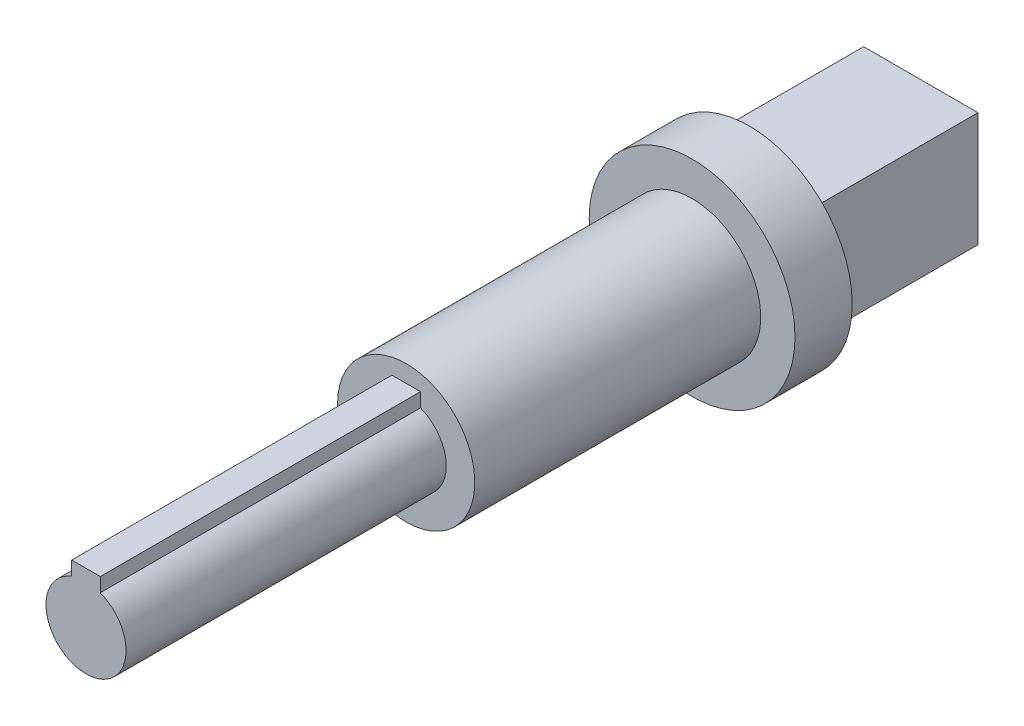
ISO-10303-21;
HEADER;
FILE_DESCRIPTION(('STEP AP214'),'2;1');
FILE_NAME('part.step','',(''),(''),'','','');
FILE_SCHEMA(('AUTOMOTIVE_DESIGN { 1 0 10303 214 1 1 1 1 }'));
ENDSEC;
DATA;
#1=APPLICATION_CONTEXT('core data for automotive mechanical design processes');
#2=APPLICATION_PROTOCOL_DEFINITION('international standard','automotive_design',2000,#1);
#3=PRODUCT_CONTEXT('',#1,'mechanical');
#4=PRODUCT('Part','Part','',(#3));
#5=PRODUCT_RELATED_PRODUCT_CATEGORY('part','',(#4));
#6=PRODUCT_DEFINITION_FORMATION('','',#4);
#7=PRODUCT_DEFINITION_CONTEXT('part definition',#1,'design');
#8=PRODUCT_DEFINITION('design','',#6,#7);
#9=PRODUCT_DEFINITION_SHAPE('','',#8);
#10=(LENGTH_UNIT() NAMED_UNIT(*) SI_UNIT(.MILLI.,.METRE.));
#11=(NAMED_UNIT(*) PLANE_ANGLE_UNIT() SI_UNIT($,.RADIAN.));
#12=(NAMED_UNIT(*) SI_UNIT($,.STERADIAN.) SOLID_ANGLE_UNIT());
#13=UNCERTAINTY_MEASURE_WITH_UNIT(LENGTH_MEASURE(1.E-05),#10,'distance_accuracy_value','');
#14=(GEOMETRIC_REPRESENTATION_CONTEXT(3) GLOBAL_UNCERTAINTY_ASSIGNED_CONTEXT((#13)) GLOBAL_UNIT_ASSIGNED_CONTEXT((#10,
#11,#12)) REPRESENTATION_CONTEXT('',''));
#15=CARTESIAN_POINT('',(0.,0.,0.));
#16=DIRECTION('',(0.,0.,1.));
#17=DIRECTION('',(1.,0.,0.));
#18=AXIS2_PLACEMENT_3D('',#15,#16,#17);
#19=CARTESIAN_POINT('',(0.,0.,-444.5));
#20=DIRECTION('',(0.,0.,1.));
#21=DIRECTION('',(1.,0.,0.));
#22=AXIS2_PLACEMENT_3D('',#19,#20,#21);
#23=PLANE('',#22);
#24=CARTESIAN_POINT('',(0.,0.,-444.5));
#25=DIRECTION('',(0.,0.,1.));
#26=DIRECTION('',(1.,0.,0.));
#27=AXIS2_PLACEMENT_3D('',#24,#25,#26);
#28=CIRCLE('',#27,228.6);
#29=CARTESIAN_POINT('',(228.6,0.,-444.5));
#30=VERTEX_POINT('',#29);
#31=EDGE_CURVE('E167',#30,#30,#28,.T.);
#32=ORIENTED_EDGE('',*,*,#31,.F.);
#33=EDGE_LOOP('',(#32));
#34=FACE_BOUND('',#33,.T.);
#35=DIRECTION('',(0.,1.,0.));
#36=VECTOR('',#35,1.);
#37=CARTESIAN_POINT('',(-127.,-127.,-444.5));
#38=LINE('',#37,#36);
#39=CARTESIAN_POINT('',(-127.,-127.,-444.5));
#40=VERTEX_POINT('',#39);
#41=CARTESIAN_POINT('',(-127.,127.,-444.5));
#42=VERTEX_POINT('',#41);
#43=EDGE_CURVE('E109',#40,#42,#38,.T.);
#44=ORIENTED_EDGE('',*,*,#43,.F.);
#45=DIRECTION('',(-1.,0.,0.));
#46=VECTOR('',#45,1.);
#47=CARTESIAN_POINT('',(127.,-127.,-444.5));
#48=LINE('',#47,#46);
#49=CARTESIAN_POINT('',(127.,-127.,-444.5));
#50=VERTEX_POINT('',#49);
#51=EDGE_CURVE('E138',#50,#40,#48,.T.);
#52=ORIENTED_EDGE('',*,*,#51,.F.);
#53=DIRECTION('',(0.,-1.,0.));
#54=VECTOR('',#53,1.);
#55=CARTESIAN_POINT('',(127.,-127.,-444.5));
#56=LINE('',#55,#54);
#57=CARTESIAN_POINT('',(127.,127.,-444.5));
#58=VERTEX_POINT('',#57);
#59=EDGE_CURVE('E150',#58,#50,#56,.T.);
#60=ORIENTED_EDGE('',*,*,#59,.F.);
#61=DIRECTION('',(1.,0.,0.));
#62=VECTOR('',#61,1.);
#63=CARTESIAN_POINT('',(127.,127.,-444.5));
#64=LINE('',#63,#62);
#65=EDGE_CURVE('E147',#42,#58,#64,.T.);
#66=ORIENTED_EDGE('',*,*,#65,.F.);
#67=EDGE_LOOP('',(#44,#52,#60,#66));
#68=FACE_BOUND('',#67,.T.);
#69=ADVANCED_FACE('F34',(#34,#68),#23,.F.);
#70=CARTESIAN_POINT('',(0.,0.,317.5));
#71=DIRECTION('',(0.,0.,-1.));
#72=DIRECTION('',(-1.,0.,0.));
#73=AXIS2_PLACEMENT_3D('',#70,#71,#72);
#74=CYLINDRICAL_SURFACE('',#73,152.4);
#75=CARTESIAN_POINT('',(0.,0.,317.5));
#76=DIRECTION('',(0.,0.,1.));
#77=DIRECTION('',(1.,0.,0.));
#78=AXIS2_PLACEMENT_3D('',#75,#76,#77);
#79=CIRCLE('',#78,152.4);
#80=CARTESIAN_POINT('',(-152.4,0.,317.5));
#81=VERTEX_POINT('',#80);
#82=EDGE_CURVE('E11',#81,#81,#79,.T.);
#83=CARTESIAN_POINT('',(0.,0.,-317.5));
#84=DIRECTION('',(0.,0.,1.));
#85=DIRECTION('',(1.,0.,0.));
#86=AXIS2_PLACEMENT_3D('',#83,#84,#85);
#87=CIRCLE('',#86,152.4);
#88=CARTESIAN_POINT('',(-152.4,0.,-317.5));
#89=VERTEX_POINT('',#88);
#90=EDGE_CURVE('E38',#89,#89,#87,.T.);
#91=CARTESIAN_POINT('',(-152.4,0.,317.5));
#92=CARTESIAN_POINT('',(-152.4,0.,310.885416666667));
#93=CARTESIAN_POINT('',(-152.4,0.,304.270833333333));
#94=CARTESIAN_POINT('',(-152.4,0.,291.041666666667));
#95=CARTESIAN_POINT('',(-152.4,0.,284.427083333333));
#96=CARTESIAN_POINT('',(-152.4,0.,271.197916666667));
#97=CARTESIAN_POINT('',(-152.4,0.,264.583333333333));
#98=CARTESIAN_POINT('',(-152.4,0.,251.354166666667));
#99=CARTESIAN_POINT('',(-152.4,0.,244.739583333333));
#100=CARTESIAN_POINT('',(-152.4,0.,231.510416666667));
#101=CARTESIAN_POINT('',(-152.4,0.,224.895833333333));
#102=CARTESIAN_POINT('',(-152.4,0.,211.666666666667));
#103=CARTESIAN_POINT('',(-152.4,0.,205.052083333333));
#104=CARTESIAN_POINT('',(-152.4,0.,191.822916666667));
#105=CARTESIAN_POINT('',(-152.4,0.,185.208333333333));
#106=CARTESIAN_POINT('',(-152.4,0.,171.979166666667));
#107=CARTESIAN_POINT('',(-152.4,0.,165.364583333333));
#108=CARTESIAN_POINT('',(-152.4,0.,152.135416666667));
#109=CARTESIAN_POINT('',(-152.4,0.,145.520833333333));
#110=CARTESIAN_POINT('',(-152.4,0.,132.291666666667));
#111=CARTESIAN_POINT('',(-152.4,0.,125.677083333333));
#112=CARTESIAN_POINT('',(-152.4,0.,112.447916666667));
#113=CARTESIAN_POINT('',(-152.4,0.,105.833333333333));
#114=CARTESIAN_POINT('',(-152.4,0.,92.6041666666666));
#115=CARTESIAN_POINT('',(-152.4,0.,85.9895833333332));
#116=CARTESIAN_POINT('',(-152.4,0.,72.7604166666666));
#117=CARTESIAN_POINT('',(-152.4,0.,66.1458333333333));
#118=CARTESIAN_POINT('',(-152.4,0.,52.9166666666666));
#119=CARTESIAN_POINT('',(-152.4,0.,46.3020833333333));
#120=CARTESIAN_POINT('',(-152.4,0.,33.0729166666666));
#121=CARTESIAN_POINT('',(-152.4,0.,26.4583333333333));
#122=CARTESIAN_POINT('',(-152.4,0.,13.2291666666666));
#123=CARTESIAN_POINT('',(-152.4,0.,6.61458333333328));
#124=CARTESIAN_POINT('',(-152.4,0.,-6.61458333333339));
#125=CARTESIAN_POINT('',(-152.4,0.,-13.2291666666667));
#126=CARTESIAN_POINT('',(-152.4,0.,-26.4583333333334));
#127=CARTESIAN_POINT('',(-152.4,0.,-33.0729166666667));
#128=CARTESIAN_POINT('',(-152.4,0.,-46.3020833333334));
#129=CARTESIAN_POINT('',(-152.4,0.,-52.9166666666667));
#130=CARTESIAN_POINT('',(-152.4,0.,-66.1458333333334));
#131=CARTESIAN_POINT('',(-152.4,0.,-72.7604166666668));
#132=CARTESIAN_POINT('',(-152.4,0.,-85.9895833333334));
#133=CARTESIAN_POINT('',(-152.4,0.,-92.6041666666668));
#134=CARTESIAN_POINT('',(-152.4,0.,-105.833333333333));
#135=CARTESIAN_POINT('',(-152.4,0.,-112.447916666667));
#136=CARTESIAN_POINT('',(-152.4,0.,-125.677083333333));
#137=CARTESIAN_POINT('',(-152.4,0.,-132.291666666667));
#138=CARTESIAN_POINT('',(-152.4,0.,-145.520833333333));
#139=CARTESIAN_POINT('',(-152.4,0.,-152.135416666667));
#140=CARTESIAN_POINT('',(-152.4,0.,-165.364583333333));
#141=CARTESIAN_POINT('',(-152.4,0.,-171.979166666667));
#142=CARTESIAN_POINT('',(-152.4,0.,-185.208333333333));
#143=CARTESIAN_POINT('',(-152.4,0.,-191.822916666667));
#144=CARTESIAN_POINT('',(-152.4,0.,-205.052083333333));
#145=CARTESIAN_POINT('',(-152.4,0.,-211.666666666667));
#146=CARTESIAN_POINT('',(-152.4,0.,-224.895833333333));
#147=CARTESIAN_POINT('',(-152.4,0.,-231.510416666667));
#148=CARTESIAN_POINT('',(-152.4,0.,-244.739583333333));
#149=CARTESIAN_POINT('',(-152.4,0.,-251.354166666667));
#150=CARTESIAN_POINT('',(-152.4,0.,-264.583333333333));
#151=CARTESIAN_POINT('',(-152.4,0.,-271.197916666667));
#152=CARTESIAN_POINT('',(-152.4,0.,-284.427083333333));
#153=CARTESIAN_POINT('',(-152.4,0.,-291.041666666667));
#154=CARTESIAN_POINT('',(-152.4,0.,-304.270833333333));
#155=CARTESIAN_POINT('',(-152.4,0.,-310.885416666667));
#156=CARTESIAN_POINT('',(-152.4,0.,-317.5));
#157=B_SPLINE_CURVE_WITH_KNOTS('',3,(#91,#92,#93,#94,#95,#96,#97,#98,#99,#100,#101,#102,#103,
#104,#105,#106,#107,#108,#109,#110,#111,#112,#113,#114,#115,#116,#117,#118,#119,#120,#121,#122,
#123,#124,#125,#126,#127,#128,#129,#130,#131,#132,#133,#134,#135,#136,#137,#138,#139,#140,#141,
#142,#143,#144,#145,#146,#147,#148,#149,#150,#151,#152,#153,#154,#155,#156),.UNSPECIFIED.,.F.,
.F.,(4,2,2,2,2,2,2,2,2,2,2,2,2,2,2,2,2,2,2,2,2,2,2,2,2,2,2,2,2,2,2,2,4),(0.,19.84375,39.6875,
59.53125,79.375,99.2187500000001,119.0625,138.90625,158.75,178.59375,198.4375,218.28125,238.125,
257.96875,277.8125,297.65625,317.5,337.34375,357.1875,377.03125,396.875,416.71875,436.5625,
456.40625,476.25,496.09375,515.9375,535.78125,555.625,575.46875,595.3125,615.15625,635.),.UNSPECIFIED.);
#158=EDGE_CURVE('BSEAM36',#81,#89,#157,.T.);
#159=ORIENTED_EDGE('',*,*,#82,.F.);
#160=ORIENTED_EDGE('',*,*,#90,.T.);
#161=ORIENTED_EDGE('',*,*,#158,.T.);
#162=ORIENTED_EDGE('',*,*,#158,.F.);
#163=EDGE_LOOP('',(#159,#161,#160,#162));
#164=FACE_BOUND('',#163,.T.);
#165=ADVANCED_FACE('F36',(#164),#74,.T.);
#166=CARTESIAN_POINT('',(0.,0.,317.5));
#167=DIRECTION('',(0.,0.,1.));
#168=DIRECTION('',(1.,0.,0.));
#169=AXIS2_PLACEMENT_3D('',#166,#167,#168);
#170=PLANE('',#169);
#171=DIRECTION('',(0.,1.,0.));
#172=VECTOR('',#171,1.);
#173=CARTESIAN_POINT('',(-31.75,114.3,317.5));
#174=LINE('',#173,#172);
#175=CARTESIAN_POINT('',(-31.75,83.0370248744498,317.5));
#176=VERTEX_POINT('',#175);
#177=CARTESIAN_POINT('',(-31.75,114.3,317.5));
#178=VERTEX_POINT('',#177);
#179=EDGE_CURVE('E49',#176,#178,#174,.T.);
#180=ORIENTED_EDGE('',*,*,#179,.T.);
#181=DIRECTION('',(1.,0.,0.));
#182=VECTOR('',#181,1.);
#183=CARTESIAN_POINT('',(-31.75,114.3,317.5));
#184=LINE('',#183,#182);
#185=CARTESIAN_POINT('',(31.75,114.3,317.5));
#186=VERTEX_POINT('',#185);
#187=EDGE_CURVE('E53',#178,#186,#184,.T.);
#188=ORIENTED_EDGE('',*,*,#187,.T.);
#189=DIRECTION('',(0.,-1.,0.));
#190=VECTOR('',#189,1.);
#191=CARTESIAN_POINT('',(31.75,114.3,317.5));
#192=LINE('',#191,#190);
#193=CARTESIAN_POINT('',(31.75,83.0370248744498,317.5));
#194=VERTEX_POINT('',#193);
#195=EDGE_CURVE('E130',#186,#194,#192,.T.);
#196=ORIENTED_EDGE('',*,*,#195,.T.);
#197=CARTESIAN_POINT('',(0.,0.,317.5));
#198=DIRECTION('',(0.,0.,-1.));
#199=DIRECTION('',(-1.,0.,0.));
#200=AXIS2_PLACEMENT_3D('',#197,#198,#199);
#201=CIRCLE('',#200,88.9);
#202=EDGE_CURVE('E110',#194,#176,#201,.T.);
#203=ORIENTED_EDGE('',*,*,#202,.T.);
#204=EDGE_LOOP('',(#180,#188,#196,#203));
#205=FACE_BOUND('',#204,.T.);
#206=ORIENTED_EDGE('',*,*,#82,.T.);
#207=EDGE_LOOP('',(#206));
#208=FACE_BOUND('',#207,.T.);
#209=ADVANCED_FACE('F177',(#205,#208),#170,.T.);
#210=CARTESIAN_POINT('',(0.,0.,-444.5));
#211=DIRECTION('',(0.,0.,1.));
#212=DIRECTION('',(1.,0.,0.));
#213=AXIS2_PLACEMENT_3D('',#210,#211,#212);
#214=CYLINDRICAL_SURFACE('',#213,228.6);
#215=ORIENTED_EDGE('',*,*,#31,.T.);
#216=EDGE_LOOP('',(#215));
#217=FACE_BOUND('',#216,.T.);
#218=CARTESIAN_POINT('',(0.,0.,-317.5));
#219=DIRECTION('',(0.,0.,1.));
#220=DIRECTION('',(1.,0.,0.));
#221=AXIS2_PLACEMENT_3D('',#218,#219,#220);
#222=CIRCLE('',#221,228.6);
#223=CARTESIAN_POINT('',(228.6,0.,-317.5));
#224=VERTEX_POINT('',#223);
#225=EDGE_CURVE('E166',#224,#224,#222,.T.);
#226=ORIENTED_EDGE('',*,*,#225,.F.);
#227=EDGE_LOOP('',(#226));
#228=FACE_BOUND('',#227,.T.);
#229=ADVANCED_FACE('F175',(#217,#228),#214,.T.);
#230=CARTESIAN_POINT('',(0.,0.,-317.5));
#231=DIRECTION('',(0.,0.,1.));
#232=DIRECTION('',(1.,0.,0.));
#233=AXIS2_PLACEMENT_3D('',#230,#231,#232);
#234=PLANE('',#233);
#235=ORIENTED_EDGE('',*,*,#90,.F.);
#236=EDGE_LOOP('',(#235));
#237=FACE_BOUND('',#236,.T.);
#238=ORIENTED_EDGE('',*,*,#225,.T.);
#239=EDGE_LOOP('',(#238));
#240=FACE_BOUND('',#239,.T.);
#241=ADVANCED_FACE('F173',(#237,#240),#234,.T.);
#242=CARTESIAN_POINT('',(-127.,-127.,-825.5));
#243=DIRECTION('',(1.,0.,0.));
#244=DIRECTION('',(0.,0.,-1.));
#245=AXIS2_PLACEMENT_3D('',#242,#243,#244);
#246=PLANE('',#245);
#247=ORIENTED_EDGE('',*,*,#43,.T.);
#248=DIRECTION('',(0.,0.,1.));
#249=VECTOR('',#248,1.);
#250=CARTESIAN_POINT('',(-127.,127.,-825.5));
#251=LINE('',#250,#249);
#252=CARTESIAN_POINT('',(-127.,127.,-825.5));
#253=VERTEX_POINT('',#252);
#254=EDGE_CURVE('E163',#253,#42,#251,.T.);
#255=ORIENTED_EDGE('',*,*,#254,.F.);
#256=DIRECTION('',(0.,1.,0.));
#257=VECTOR('',#256,1.);
#258=CARTESIAN_POINT('',(-127.,-127.,-825.5));
#259=LINE('',#258,#257);
#260=CARTESIAN_POINT('',(-127.,-127.,-825.5));
#261=VERTEX_POINT('',#260);
#262=EDGE_CURVE('E134',#261,#253,#259,.T.);
#263=ORIENTED_EDGE('',*,*,#262,.F.);
#264=DIRECTION('',(0.,0.,1.));
#265=VECTOR('',#264,1.);
#266=CARTESIAN_POINT('',(-127.,-127.,-825.5));
#267=LINE('',#266,#265);
#268=EDGE_CURVE('E144',#261,#40,#267,.T.);
#269=ORIENTED_EDGE('',*,*,#268,.T.);
#270=EDGE_LOOP('',(#247,#255,#263,#269));
#271=FACE_BOUND('',#270,.T.);
#272=ADVANCED_FACE('F184',(#271),#246,.F.);
#273=CARTESIAN_POINT('',(127.,127.,-825.5));
#274=DIRECTION('',(0.,-1.,0.));
#275=DIRECTION('',(0.,0.,-1.));
#276=AXIS2_PLACEMENT_3D('',#273,#274,#275);
#277=PLANE('',#276);
#278=ORIENTED_EDGE('',*,*,#65,.T.);
#279=DIRECTION('',(0.,0.,1.));
#280=VECTOR('',#279,1.);
#281=CARTESIAN_POINT('',(127.,127.,-825.5));
#282=LINE('',#281,#280);
#283=CARTESIAN_POINT('',(127.,127.,-825.5));
#284=VERTEX_POINT('',#283);
#285=EDGE_CURVE('E160',#284,#58,#282,.T.);
#286=ORIENTED_EDGE('',*,*,#285,.F.);
#287=DIRECTION('',(1.,0.,0.));
#288=VECTOR('',#287,1.);
#289=CARTESIAN_POINT('',(127.,127.,-825.5));
#290=LINE('',#289,#288);
#291=EDGE_CURVE('E137',#253,#284,#290,.T.);
#292=ORIENTED_EDGE('',*,*,#291,.F.);
#293=ORIENTED_EDGE('',*,*,#254,.T.);
#294=EDGE_LOOP('',(#278,#286,#292,#293));
#295=FACE_BOUND('',#294,.T.);
#296=ADVANCED_FACE('F199',(#295),#277,.F.);
#297=CARTESIAN_POINT('',(127.,-127.,-825.5));
#298=DIRECTION('',(-1.,0.,0.));
#299=DIRECTION('',(0.,0.,1.));
#300=AXIS2_PLACEMENT_3D('',#297,#298,#299);
#301=PLANE('',#300);
#302=ORIENTED_EDGE('',*,*,#59,.T.);
#303=DIRECTION('',(0.,0.,1.));
#304=VECTOR('',#303,1.);
#305=CARTESIAN_POINT('',(127.,-127.,-825.5));
#306=LINE('',#305,#304);
#307=CARTESIAN_POINT('',(127.,-127.,-825.5));
#308=VERTEX_POINT('',#307);
#309=EDGE_CURVE('E157',#308,#50,#306,.T.);
#310=ORIENTED_EDGE('',*,*,#309,.F.);
#311=DIRECTION('',(0.,-1.,0.));
#312=VECTOR('',#311,1.);
#313=CARTESIAN_POINT('',(127.,-127.,-825.5));
#314=LINE('',#313,#312);
#315=EDGE_CURVE('E140',#284,#308,#314,.T.);
#316=ORIENTED_EDGE('',*,*,#315,.F.);
#317=ORIENTED_EDGE('',*,*,#285,.T.);
#318=EDGE_LOOP('',(#302,#310,#316,#317));
#319=FACE_BOUND('',#318,.T.);
#320=ADVANCED_FACE('F203',(#319),#301,.F.);
#321=CARTESIAN_POINT('',(127.,-127.,-825.5));
#322=DIRECTION('',(0.,1.,0.));
#323=DIRECTION('',(0.,0.,1.));
#324=AXIS2_PLACEMENT_3D('',#321,#322,#323);
#325=PLANE('',#324);
#326=ORIENTED_EDGE('',*,*,#51,.T.);
#327=ORIENTED_EDGE('',*,*,#268,.F.);
#328=DIRECTION('',(-1.,0.,0.));
#329=VECTOR('',#328,1.);
#330=CARTESIAN_POINT('',(127.,-127.,-825.5));
#331=LINE('',#330,#329);
#332=EDGE_CURVE('E142',#308,#261,#331,.T.);
#333=ORIENTED_EDGE('',*,*,#332,.F.);
#334=ORIENTED_EDGE('',*,*,#309,.T.);
#335=EDGE_LOOP('',(#326,#327,#333,#334));
#336=FACE_BOUND('',#335,.T.);
#337=ADVANCED_FACE('F207',(#336),#325,.F.);
#338=CARTESIAN_POINT('',(0.,0.,-825.5));
#339=DIRECTION('',(0.,0.,1.));
#340=DIRECTION('',(1.,0.,0.));
#341=AXIS2_PLACEMENT_3D('',#338,#339,#340);
#342=PLANE('',#341);
#343=ORIENTED_EDGE('',*,*,#262,.T.);
#344=ORIENTED_EDGE('',*,*,#291,.T.);
#345=ORIENTED_EDGE('',*,*,#315,.T.);
#346=ORIENTED_EDGE('',*,*,#332,.T.);
#347=EDGE_LOOP('',(#343,#344,#345,#346));
#348=FACE_BOUND('',#347,.T.);
#349=ADVANCED_FACE('F211',(#348),#342,.F.);
#350=CARTESIAN_POINT('',(0.,0.,1028.7));
#351=DIRECTION('',(0.,0.,-1.));
#352=DIRECTION('',(-1.,0.,0.));
#353=AXIS2_PLACEMENT_3D('',#350,#351,#352);
#354=CYLINDRICAL_SURFACE('',#353,88.9);
#355=DIRECTION('',(0.,0.,1.));
#356=VECTOR('',#355,1.);
#357=CARTESIAN_POINT('',(-31.75,83.0370248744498,246.721305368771));
#358=LINE('',#357,#356);
#359=CARTESIAN_POINT('',(-31.75,83.0370248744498,1028.7));
#360=VERTEX_POINT('',#359);
#361=EDGE_CURVE('E118',#176,#360,#358,.T.);
#362=ORIENTED_EDGE('',*,*,#361,.F.);
#363=ORIENTED_EDGE('',*,*,#202,.F.);
#364=DIRECTION('',(0.,0.,1.));
#365=VECTOR('',#364,1.);
#366=CARTESIAN_POINT('',(31.75,83.0370248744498,246.721305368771));
#367=LINE('',#366,#365);
#368=CARTESIAN_POINT('',(31.75,83.0370248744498,1028.7));
#369=VERTEX_POINT('',#368);
#370=EDGE_CURVE('E114',#194,#369,#367,.T.);
#371=ORIENTED_EDGE('',*,*,#370,.T.);
#372=CARTESIAN_POINT('',(0.,0.,1028.7));
#373=DIRECTION('',(0.,0.,-1.));
#374=DIRECTION('',(-1.,0.,0.));
#375=AXIS2_PLACEMENT_3D('',#372,#373,#374);
#376=CIRCLE('',#375,88.9);
#377=EDGE_CURVE('E98',#369,#360,#376,.T.);
#378=ORIENTED_EDGE('',*,*,#377,.T.);
#379=EDGE_LOOP('',(#362,#363,#371,#378));
#380=FACE_BOUND('',#379,.T.);
#381=ADVANCED_FACE('F115',(#380),#354,.T.);
#382=CARTESIAN_POINT('',(0.,0.,1028.7));
#383=DIRECTION('',(0.,0.,-1.));
#384=DIRECTION('',(-1.,0.,0.));
#385=AXIS2_PLACEMENT_3D('',#382,#383,#384);
#386=PLANE('',#385);
#387=ORIENTED_EDGE('',*,*,#377,.F.);
#388=DIRECTION('',(0.,1.,0.));
#389=VECTOR('',#388,1.);
#390=CARTESIAN_POINT('',(31.75,114.3,1028.7));
#391=LINE('',#390,#389);
#392=CARTESIAN_POINT('',(31.75,114.3,1028.7));
#393=VERTEX_POINT('',#392);
#394=EDGE_CURVE('E103',#369,#393,#391,.T.);
#395=ORIENTED_EDGE('',*,*,#394,.T.);
#396=DIRECTION('',(-1.,0.,0.));
#397=VECTOR('',#396,1.);
#398=CARTESIAN_POINT('',(-31.75,114.3,1028.7));
#399=LINE('',#398,#397);
#400=CARTESIAN_POINT('',(-31.75,114.3,1028.7));
#401=VERTEX_POINT('',#400);
#402=EDGE_CURVE('E122',#393,#401,#399,.T.);
#403=ORIENTED_EDGE('',*,*,#402,.T.);
#404=DIRECTION('',(0.,-1.,0.));
#405=VECTOR('',#404,1.);
#406=CARTESIAN_POINT('',(-31.75,114.3,1028.7));
#407=LINE('',#406,#405);
#408=EDGE_CURVE('E106',#401,#360,#407,.T.);
#409=ORIENTED_EDGE('',*,*,#408,.T.);
#410=EDGE_LOOP('',(#387,#395,#403,#409));
#411=FACE_BOUND('',#410,.T.);
#412=ADVANCED_FACE('F100',(#411),#386,.F.);
#413=CARTESIAN_POINT('',(-31.75,114.3,246.721305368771));
#414=DIRECTION('',(-1.,0.,0.));
#415=DIRECTION('',(0.,0.,1.));
#416=AXIS2_PLACEMENT_3D('',#413,#414,#415);
#417=PLANE('',#416);
#418=ORIENTED_EDGE('',*,*,#179,.F.);
#419=ORIENTED_EDGE('',*,*,#361,.T.);
#420=ORIENTED_EDGE('',*,*,#408,.F.);
#421=DIRECTION('',(0.,0.,1.));
#422=VECTOR('',#421,1.);
#423=CARTESIAN_POINT('',(-31.75,114.3,246.721305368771));
#424=LINE('',#423,#422);
#425=EDGE_CURVE('E128',#178,#401,#424,.T.);
#426=ORIENTED_EDGE('',*,*,#425,.F.);
#427=EDGE_LOOP('',(#418,#419,#420,#426));
#428=FACE_BOUND('',#427,.T.);
#429=ADVANCED_FACE('F220',(#428),#417,.T.);
#430=CARTESIAN_POINT('',(-31.75,114.3,246.721305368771));
#431=DIRECTION('',(0.,1.,0.));
#432=DIRECTION('',(0.,0.,1.));
#433=AXIS2_PLACEMENT_3D('',#430,#431,#432);
#434=PLANE('',#433);
#435=ORIENTED_EDGE('',*,*,#187,.F.);
#436=ORIENTED_EDGE('',*,*,#425,.T.);
#437=ORIENTED_EDGE('',*,*,#402,.F.);
#438=DIRECTION('',(0.,0.,1.));
#439=VECTOR('',#438,1.);
#440=CARTESIAN_POINT('',(31.75,114.3,246.721305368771));
#441=LINE('',#440,#439);
#442=EDGE_CURVE('E117',#186,#393,#441,.T.);
#443=ORIENTED_EDGE('',*,*,#442,.F.);
#444=EDGE_LOOP('',(#435,#436,#437,#443));
#445=FACE_BOUND('',#444,.T.);
#446=ADVANCED_FACE('F223',(#445),#434,.T.);
#447=CARTESIAN_POINT('',(31.75,114.3,246.721305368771));
#448=DIRECTION('',(1.,0.,0.));
#449=DIRECTION('',(0.,0.,-1.));
#450=AXIS2_PLACEMENT_3D('',#447,#448,#449);
#451=PLANE('',#450);
#452=ORIENTED_EDGE('',*,*,#195,.F.);
#453=ORIENTED_EDGE('',*,*,#442,.T.);
#454=ORIENTED_EDGE('',*,*,#394,.F.);
#455=ORIENTED_EDGE('',*,*,#370,.F.);
#456=EDGE_LOOP('',(#452,#453,#454,#455));
#457=FACE_BOUND('',#456,.T.);
#458=ADVANCED_FACE('F120',(#457),#451,.T.);
#459=CLOSED_SHELL('',(#69,#165,#209,#229,#241,#272,#296,#320,#337,#349,#381,#412,#429,#446,#458));
#460=MANIFOLD_SOLID_BREP('B2',#459);
#461=ADVANCED_BREP_SHAPE_REPRESENTATION('',(#18,#460),#14);
#462=SHAPE_DEFINITION_REPRESENTATION(#9,#461);
ENDSEC;
END-ISO-10303-21;
